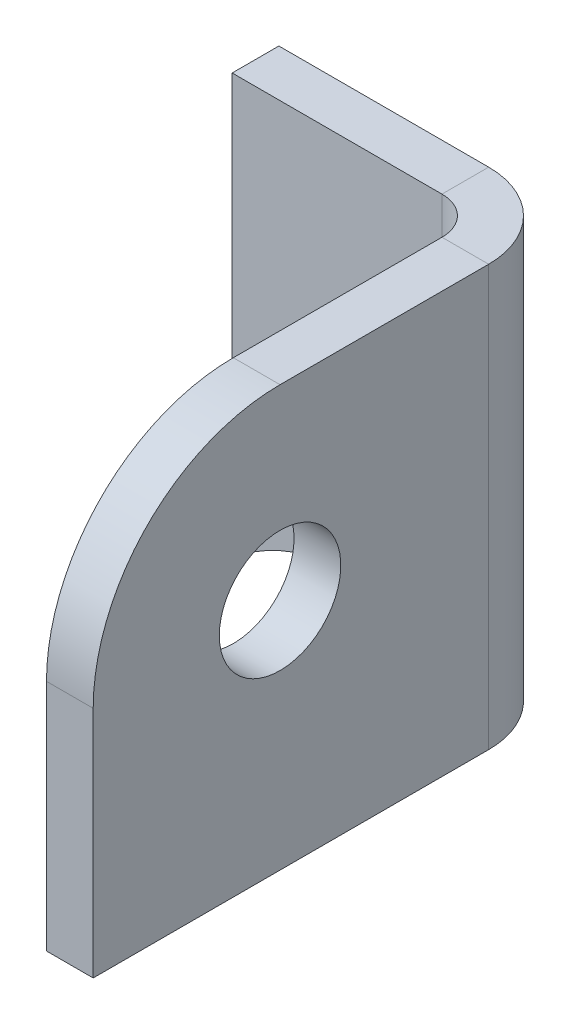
ISO-10303-21;
HEADER;
FILE_DESCRIPTION(('STEP AP214'),'2;1');
FILE_NAME('part.step','',(''),(''),'','','');
FILE_SCHEMA(('AUTOMOTIVE_DESIGN { 1 0 10303 214 1 1 1 1 }'));
ENDSEC;
DATA;
#1=APPLICATION_CONTEXT('core data for automotive mechanical design processes');
#2=APPLICATION_PROTOCOL_DEFINITION('international standard','automotive_design',2000,#1);
#3=PRODUCT_CONTEXT('',#1,'mechanical');
#4=PRODUCT('Part','Part','',(#3));
#5=PRODUCT_RELATED_PRODUCT_CATEGORY('part','',(#4));
#6=PRODUCT_DEFINITION_FORMATION('','',#4);
#7=PRODUCT_DEFINITION_CONTEXT('part definition',#1,'design');
#8=PRODUCT_DEFINITION('design','',#6,#7);
#9=PRODUCT_DEFINITION_SHAPE('','',#8);
#10=(LENGTH_UNIT() NAMED_UNIT(*) SI_UNIT(.MILLI.,.METRE.));
#11=(NAMED_UNIT(*) PLANE_ANGLE_UNIT() SI_UNIT($,.RADIAN.));
#12=(NAMED_UNIT(*) SI_UNIT($,.STERADIAN.) SOLID_ANGLE_UNIT());
#13=UNCERTAINTY_MEASURE_WITH_UNIT(LENGTH_MEASURE(1.E-05),#10,'distance_accuracy_value','');
#14=(GEOMETRIC_REPRESENTATION_CONTEXT(3) GLOBAL_UNCERTAINTY_ASSIGNED_CONTEXT((#13)) GLOBAL_UNIT_ASSIGNED_CONTEXT((#10,
#11,#12)) REPRESENTATION_CONTEXT('',''));
#15=CARTESIAN_POINT('',(0.,0.,0.));
#16=DIRECTION('',(0.,0.,1.));
#17=DIRECTION('',(1.,0.,0.));
#18=AXIS2_PLACEMENT_3D('',#15,#16,#17);
#19=CARTESIAN_POINT('',(16.80052301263,1.08510692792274E-06,1.77153816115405));
#20=DIRECTION('',(0.,-1.,0.));
#21=DIRECTION('',(0.,0.,1.));
#22=AXIS2_PLACEMENT_3D('',#19,#20,#21);
#23=PLANE('',#22);
#24=DIRECTION('',(0.,0.,1.));
#25=VECTOR('',#24,1.);
#26=CARTESIAN_POINT('',(16.80052301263,1.08510692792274E-06,1.77153816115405));
#27=LINE('',#26,#25);
#28=CARTESIAN_POINT('',(16.80052301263,1.08510692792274E-06,5.71500000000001));
#29=VERTEX_POINT('',#28);
#30=CARTESIAN_POINT('',(16.8005230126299,1.08510692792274E-06,32.596015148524));
#31=VERTEX_POINT('',#30);
#32=EDGE_CURVE('E155',#29,#31,#27,.T.);
#33=ORIENTED_EDGE('',*,*,#32,.F.);
#34=DIRECTION('',(1.,0.,0.));
#35=VECTOR('',#34,1.);
#36=CARTESIAN_POINT('',(16.80052301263,1.08510692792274E-06,5.71500000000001));
#37=LINE('',#36,#35);
#38=CARTESIAN_POINT('',(19.97552301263,1.08510691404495E-06,5.71500000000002));
#39=VERTEX_POINT('',#38);
#40=EDGE_CURVE('E12',#29,#39,#37,.T.);
#41=ORIENTED_EDGE('',*,*,#40,.T.);
#42=DIRECTION('',(0.,0.,1.));
#43=VECTOR('',#42,1.);
#44=CARTESIAN_POINT('',(19.9755230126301,1.08510692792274E-06,-6.62872272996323));
#45=LINE('',#44,#43);
#46=CARTESIAN_POINT('',(19.9755230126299,1.08510692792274E-06,32.596015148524));
#47=VERTEX_POINT('',#46);
#48=EDGE_CURVE('E120',#39,#47,#45,.T.);
#49=ORIENTED_EDGE('',*,*,#48,.T.);
#50=DIRECTION('',(-1.,0.,0.));
#51=VECTOR('',#50,1.);
#52=CARTESIAN_POINT('',(16.8005230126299,1.08510692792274E-06,32.596015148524));
#53=LINE('',#52,#51);
#54=EDGE_CURVE('E163',#47,#31,#53,.T.);
#55=ORIENTED_EDGE('',*,*,#54,.T.);
#56=EDGE_LOOP('',(#33,#41,#49,#55));
#57=FACE_BOUND('',#56,.T.);
#58=ADVANCED_FACE('F77',(#57),#23,.T.);
#59=CARTESIAN_POINT('',(16.80052301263,28.575,19.8960151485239));
#60=DIRECTION('',(0.,1.,0.));
#61=DIRECTION('',(0.,0.,-1.));
#62=AXIS2_PLACEMENT_3D('',#59,#60,#61);
#63=PLANE('',#62);
#64=DIRECTION('',(0.,0.,1.));
#65=VECTOR('',#64,1.);
#66=CARTESIAN_POINT('',(19.9755230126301,28.575,-6.62872272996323));
#67=LINE('',#66,#65);
#68=CARTESIAN_POINT('',(19.97552301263,28.575,19.896015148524));
#69=VERTEX_POINT('',#68);
#70=CARTESIAN_POINT('',(19.97552301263,28.575,5.71500000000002));
#71=VERTEX_POINT('',#70);
#72=EDGE_CURVE('E187',#69,#71,#67,.F.);
#73=ORIENTED_EDGE('',*,*,#72,.T.);
#74=DIRECTION('',(-1.,0.,0.));
#75=VECTOR('',#74,1.);
#76=CARTESIAN_POINT('',(16.80052301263,28.575,5.71500000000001));
#77=LINE('',#76,#75);
#78=CARTESIAN_POINT('',(16.80052301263,28.575,5.71500000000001));
#79=VERTEX_POINT('',#78);
#80=EDGE_CURVE('E200',#71,#79,#77,.T.);
#81=ORIENTED_EDGE('',*,*,#80,.T.);
#82=DIRECTION('',(0.,0.,-1.));
#83=VECTOR('',#82,1.);
#84=CARTESIAN_POINT('',(16.80052301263,28.575,19.8960151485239));
#85=LINE('',#84,#83);
#86=CARTESIAN_POINT('',(16.80052301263,28.575,19.8960151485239));
#87=VERTEX_POINT('',#86);
#88=EDGE_CURVE('E80',#87,#79,#85,.T.);
#89=ORIENTED_EDGE('',*,*,#88,.F.);
#90=DIRECTION('',(-1.,0.,0.));
#91=VECTOR('',#90,1.);
#92=CARTESIAN_POINT('',(16.80052301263,28.575,19.8960151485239));
#93=LINE('',#92,#91);
#94=EDGE_CURVE('E103',#69,#87,#93,.T.);
#95=ORIENTED_EDGE('',*,*,#94,.F.);
#96=EDGE_LOOP('',(#73,#81,#89,#95));
#97=FACE_BOUND('',#96,.T.);
#98=ADVANCED_FACE('F216',(#97),#63,.T.);
#99=CARTESIAN_POINT('',(16.8005230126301,-9.52499945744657,-6.62872272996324));
#100=DIRECTION('',(-1.,0.,0.));
#101=DIRECTION('',(0.,0.,1.));
#102=AXIS2_PLACEMENT_3D('',#99,#100,#101);
#103=PLANE('',#102);
#104=CARTESIAN_POINT('',(16.80052301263,15.875,19.896015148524));
#105=DIRECTION('',(-1.,0.,0.));
#106=DIRECTION('',(0.,0.,1.));
#107=AXIS2_PLACEMENT_3D('',#104,#105,#106);
#108=CIRCLE('',#107,4.1275);
#109=CARTESIAN_POINT('',(16.80052301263,15.875,24.023515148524));
#110=VERTEX_POINT('',#109);
#111=EDGE_CURVE('E180',#110,#110,#108,.T.);
#112=ORIENTED_EDGE('',*,*,#111,.F.);
#113=EDGE_LOOP('',(#112));
#114=FACE_BOUND('',#113,.T.);
#115=ORIENTED_EDGE('',*,*,#88,.T.);
#116=DIRECTION('',(0.,-1.,0.));
#117=VECTOR('',#116,1.);
#118=CARTESIAN_POINT('',(16.80052301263,-9.52499945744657,5.71500000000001));
#119=LINE('',#118,#117);
#120=EDGE_CURVE('E160',#79,#29,#119,.T.);
#121=ORIENTED_EDGE('',*,*,#120,.T.);
#122=ORIENTED_EDGE('',*,*,#32,.T.);
#123=DIRECTION('',(0.,1.,0.));
#124=VECTOR('',#123,1.);
#125=CARTESIAN_POINT('',(16.8005230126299,1.08510692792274E-06,32.596015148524));
#126=LINE('',#125,#124);
#127=CARTESIAN_POINT('',(16.8005230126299,15.8749999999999,32.596015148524));
#128=VERTEX_POINT('',#127);
#129=EDGE_CURVE('E159',#31,#128,#126,.T.);
#130=ORIENTED_EDGE('',*,*,#129,.T.);
#131=CARTESIAN_POINT('',(16.80052301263,15.875,19.896015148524));
#132=DIRECTION('',(-1.,0.,0.));
#133=DIRECTION('',(0.,0.,1.));
#134=AXIS2_PLACEMENT_3D('',#131,#132,#133);
#135=CIRCLE('',#134,12.7);
#136=EDGE_CURVE('E172',#128,#87,#135,.T.);
#137=ORIENTED_EDGE('',*,*,#136,.T.);
#138=EDGE_LOOP('',(#115,#121,#122,#130,#137));
#139=FACE_BOUND('',#138,.T.);
#140=ADVANCED_FACE('F157',(#114,#139),#103,.T.);
#141=CARTESIAN_POINT('',(16.8005230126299,1.08510692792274E-06,32.596015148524));
#142=DIRECTION('',(0.,0.,1.));
#143=DIRECTION('',(0.,1.,0.));
#144=AXIS2_PLACEMENT_3D('',#141,#142,#143);
#145=PLANE('',#144);
#146=ORIENTED_EDGE('',*,*,#54,.F.);
#147=DIRECTION('',(0.,1.,0.));
#148=VECTOR('',#147,1.);
#149=CARTESIAN_POINT('',(19.9755230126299,-9.52499945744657,32.596015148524));
#150=LINE('',#149,#148);
#151=CARTESIAN_POINT('',(19.9755230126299,15.8749999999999,32.596015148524));
#152=VERTEX_POINT('',#151);
#153=EDGE_CURVE('E188',#47,#152,#150,.T.);
#154=ORIENTED_EDGE('',*,*,#153,.T.);
#155=DIRECTION('',(-1.,0.,0.));
#156=VECTOR('',#155,1.);
#157=CARTESIAN_POINT('',(16.8005230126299,15.8749999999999,32.596015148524));
#158=LINE('',#157,#156);
#159=EDGE_CURVE('E168',#152,#128,#158,.T.);
#160=ORIENTED_EDGE('',*,*,#159,.T.);
#161=ORIENTED_EDGE('',*,*,#129,.F.);
#162=EDGE_LOOP('',(#146,#154,#160,#161));
#163=FACE_BOUND('',#162,.T.);
#164=ADVANCED_FACE('F170',(#163),#145,.T.);
#165=CARTESIAN_POINT('',(16.80052301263,15.875,19.896015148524));
#166=DIRECTION('',(-1.,0.,0.));
#167=DIRECTION('',(0.,0.,1.));
#168=AXIS2_PLACEMENT_3D('',#165,#166,#167);
#169=CYLINDRICAL_SURFACE('',#168,12.7);
#170=ORIENTED_EDGE('',*,*,#159,.F.);
#171=CARTESIAN_POINT('',(19.97552301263,15.875,19.8960151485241));
#172=DIRECTION('',(-1.,0.,0.));
#173=DIRECTION('',(0.,0.,1.));
#174=AXIS2_PLACEMENT_3D('',#171,#172,#173);
#175=CIRCLE('',#174,12.7);
#176=EDGE_CURVE('E184',#152,#69,#175,.T.);
#177=ORIENTED_EDGE('',*,*,#176,.T.);
#178=ORIENTED_EDGE('',*,*,#94,.T.);
#179=ORIENTED_EDGE('',*,*,#136,.F.);
#180=EDGE_LOOP('',(#170,#177,#178,#179));
#181=FACE_BOUND('',#180,.T.);
#182=ADVANCED_FACE('F347',(#181),#169,.T.);
#183=CARTESIAN_POINT('',(16.80052301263,15.875,19.896015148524));
#184=DIRECTION('',(-1.,0.,0.));
#185=DIRECTION('',(0.,0.,1.));
#186=AXIS2_PLACEMENT_3D('',#183,#184,#185);
#187=CYLINDRICAL_SURFACE('',#186,4.1275);
#188=ORIENTED_EDGE('',*,*,#111,.T.);
#189=EDGE_LOOP('',(#188));
#190=FACE_BOUND('',#189,.T.);
#191=CARTESIAN_POINT('',(19.97552301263,15.875,19.8960151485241));
#192=DIRECTION('',(-1.,0.,0.));
#193=DIRECTION('',(0.,0.,1.));
#194=AXIS2_PLACEMENT_3D('',#191,#192,#193);
#195=CIRCLE('',#194,4.1275);
#196=CARTESIAN_POINT('',(19.97552301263,15.875,24.023515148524));
#197=VERTEX_POINT('',#196);
#198=EDGE_CURVE('E162',#197,#197,#195,.T.);
#199=ORIENTED_EDGE('',*,*,#198,.F.);
#200=EDGE_LOOP('',(#199));
#201=FACE_BOUND('',#200,.T.);
#202=ADVANCED_FACE('F441',(#190,#201),#187,.F.);
#203=CARTESIAN_POINT('',(19.9755230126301,-9.52499945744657,-6.62872272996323));
#204=DIRECTION('',(-1.,0.,0.));
#205=DIRECTION('',(0.,0.,1.));
#206=AXIS2_PLACEMENT_3D('',#203,#204,#205);
#207=PLANE('',#206);
#208=DIRECTION('',(0.,-1.,0.));
#209=VECTOR('',#208,1.);
#210=CARTESIAN_POINT('',(19.97552301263,-9.52499945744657,5.71500000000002));
#211=LINE('',#210,#209);
#212=EDGE_CURVE('E86',#71,#39,#211,.T.);
#213=ORIENTED_EDGE('',*,*,#212,.F.);
#214=ORIENTED_EDGE('',*,*,#72,.F.);
#215=ORIENTED_EDGE('',*,*,#176,.F.);
#216=ORIENTED_EDGE('',*,*,#153,.F.);
#217=ORIENTED_EDGE('',*,*,#48,.F.);
#218=EDGE_LOOP('',(#213,#214,#215,#216,#217));
#219=FACE_BOUND('',#218,.T.);
#220=ORIENTED_EDGE('',*,*,#198,.T.);
#221=EDGE_LOOP('',(#220));
#222=FACE_BOUND('',#221,.T.);
#223=ADVANCED_FACE('F224',(#219,#222),#207,.F.);
#224=CARTESIAN_POINT('',(0.,0.,3.175));
#225=DIRECTION('',(-1.,0.,0.));
#226=DIRECTION('',(0.,-1.,0.));
#227=AXIS2_PLACEMENT_3D('',#224,#225,#226);
#228=PLANE('',#227);
#229=DIRECTION('',(0.,0.,1.));
#230=VECTOR('',#229,1.);
#231=CARTESIAN_POINT('',(0.,28.575,3.175));
#232=LINE('',#231,#230);
#233=CARTESIAN_POINT('',(0.,28.575,0.));
#234=VERTEX_POINT('',#233);
#235=CARTESIAN_POINT('',(0.,28.575,3.175));
#236=VERTEX_POINT('',#235);
#237=EDGE_CURVE('E316',#234,#236,#232,.T.);
#238=ORIENTED_EDGE('',*,*,#237,.F.);
#239=DIRECTION('',(0.,1.,0.));
#240=VECTOR('',#239,1.);
#241=CARTESIAN_POINT('',(0.,-9.52499945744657,0.));
#242=LINE('',#241,#240);
#243=CARTESIAN_POINT('',(0.,0.,0.));
#244=VERTEX_POINT('',#243);
#245=EDGE_CURVE('E383',#234,#244,#242,.F.);
#246=ORIENTED_EDGE('',*,*,#245,.T.);
#247=DIRECTION('',(0.,0.,1.));
#248=VECTOR('',#247,1.);
#249=CARTESIAN_POINT('',(0.,0.,3.175));
#250=LINE('',#249,#248);
#251=CARTESIAN_POINT('',(0.,0.,3.175));
#252=VERTEX_POINT('',#251);
#253=EDGE_CURVE('E129',#244,#252,#250,.T.);
#254=ORIENTED_EDGE('',*,*,#253,.T.);
#255=DIRECTION('',(0.,-1.,0.));
#256=VECTOR('',#255,1.);
#257=CARTESIAN_POINT('',(0.,0.,3.175));
#258=LINE('',#257,#256);
#259=EDGE_CURVE('E370',#236,#252,#258,.T.);
#260=ORIENTED_EDGE('',*,*,#259,.F.);
#261=EDGE_LOOP('',(#238,#246,#254,#260));
#262=FACE_BOUND('',#261,.T.);
#263=ADVANCED_FACE('F327',(#262),#228,.T.);
#264=CARTESIAN_POINT('',(8.40026212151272,-9.52499945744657,3.175));
#265=DIRECTION('',(0.,0.,1.));
#266=DIRECTION('',(1.,0.,0.));
#267=AXIS2_PLACEMENT_3D('',#264,#265,#266);
#268=PLANE('',#267);
#269=DIRECTION('',(0.,-1.,0.));
#270=VECTOR('',#269,1.);
#271=CARTESIAN_POINT('',(14.26052301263,-9.52499945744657,3.175));
#272=LINE('',#271,#270);
#273=CARTESIAN_POINT('',(14.26052301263,28.575,3.175));
#274=VERTEX_POINT('',#273);
#275=CARTESIAN_POINT('',(14.26052301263,1.74209247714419,3.175));
#276=VERTEX_POINT('',#275);
#277=EDGE_CURVE('E356',#274,#276,#272,.T.);
#278=ORIENTED_EDGE('',*,*,#277,.F.);
#279=DIRECTION('',(-1.,0.,0.));
#280=VECTOR('',#279,1.);
#281=CARTESIAN_POINT('',(34.9249999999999,28.575,3.175));
#282=LINE('',#281,#280);
#283=EDGE_CURVE('E375',#274,#236,#282,.T.);
#284=ORIENTED_EDGE('',*,*,#283,.T.);
#285=ORIENTED_EDGE('',*,*,#259,.T.);
#286=CARTESIAN_POINT('',(8.40026212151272,-9.52499945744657,3.175));
#287=DIRECTION('',(0.,0.,-1.));
#288=DIRECTION('',(1.,0.,0.));
#289=AXIS2_PLACEMENT_3D('',#286,#287,#288);
#290=CIRCLE('',#289,12.7000007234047);
#291=EDGE_CURVE('E367',#252,#276,#290,.T.);
#292=ORIENTED_EDGE('',*,*,#291,.T.);
#293=EDGE_LOOP('',(#278,#284,#285,#292));
#294=FACE_BOUND('',#293,.T.);
#295=ADVANCED_FACE('F330',(#294),#268,.T.);
#296=CARTESIAN_POINT('',(34.9249999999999,28.575,3.175));
#297=DIRECTION('',(0.,1.,0.));
#298=DIRECTION('',(-1.,0.,0.));
#299=AXIS2_PLACEMENT_3D('',#296,#297,#298);
#300=PLANE('',#299);
#301=DIRECTION('',(0.,0.,1.));
#302=VECTOR('',#301,1.);
#303=CARTESIAN_POINT('',(14.26052301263,28.575,3.175));
#304=LINE('',#303,#302);
#305=CARTESIAN_POINT('',(14.26052301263,28.575,0.));
#306=VERTEX_POINT('',#305);
#307=EDGE_CURVE('E387',#306,#274,#304,.T.);
#308=ORIENTED_EDGE('',*,*,#307,.F.);
#309=DIRECTION('',(1.,0.,0.));
#310=VECTOR('',#309,1.);
#311=CARTESIAN_POINT('',(8.40026212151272,28.575,0.));
#312=LINE('',#311,#310);
#313=EDGE_CURVE('E369',#306,#234,#312,.F.);
#314=ORIENTED_EDGE('',*,*,#313,.T.);
#315=ORIENTED_EDGE('',*,*,#237,.T.);
#316=ORIENTED_EDGE('',*,*,#283,.F.);
#317=EDGE_LOOP('',(#308,#314,#315,#316));
#318=FACE_BOUND('',#317,.T.);
#319=ADVANCED_FACE('F334',(#318),#300,.T.);
#320=CARTESIAN_POINT('',(8.40026212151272,-9.52499945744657,0.));
#321=DIRECTION('',(0.,0.,1.));
#322=DIRECTION('',(1.,0.,0.));
#323=AXIS2_PLACEMENT_3D('',#320,#321,#322);
#324=PLANE('',#323);
#325=ORIENTED_EDGE('',*,*,#313,.F.);
#326=DIRECTION('',(0.,-1.,0.));
#327=VECTOR('',#326,1.);
#328=CARTESIAN_POINT('',(14.26052301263,-9.52499945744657,0.));
#329=LINE('',#328,#327);
#330=CARTESIAN_POINT('',(14.26052301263,1.74209247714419,0.));
#331=VERTEX_POINT('',#330);
#332=EDGE_CURVE('E393',#306,#331,#329,.T.);
#333=ORIENTED_EDGE('',*,*,#332,.T.);
#334=CARTESIAN_POINT('',(8.40026212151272,-9.52499945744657,0.));
#335=DIRECTION('',(0.,0.,-1.));
#336=DIRECTION('',(-1.,0.,0.));
#337=AXIS2_PLACEMENT_3D('',#334,#335,#336);
#338=CIRCLE('',#337,12.7000007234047);
#339=EDGE_CURVE('E209',#244,#331,#338,.T.);
#340=ORIENTED_EDGE('',*,*,#339,.F.);
#341=ORIENTED_EDGE('',*,*,#245,.F.);
#342=EDGE_LOOP('',(#325,#333,#340,#341));
#343=FACE_BOUND('',#342,.T.);
#344=ADVANCED_FACE('F338',(#343),#324,.F.);
#345=CARTESIAN_POINT('',(8.40026212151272,-9.52499945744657,3.175));
#346=DIRECTION('',(0.,0.,1.));
#347=DIRECTION('',(1.,0.,0.));
#348=AXIS2_PLACEMENT_3D('',#345,#346,#347);
#349=CYLINDRICAL_SURFACE('',#348,12.7000007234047);
#350=CARTESIAN_POINT('',(14.26052301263,1.74209247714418,3.175));
#351=CARTESIAN_POINT('',(14.26052301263,1.74209247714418,0.));
#352=B_SPLINE_CURVE_WITH_KNOTS('',1,(#350,#351),.UNSPECIFIED.,.F.,.F.,(2,2),(0.,1.),.UNSPECIFIED.);
#353=EDGE_CURVE('E365',#276,#331,#352,.T.);
#354=ORIENTED_EDGE('',*,*,#353,.F.);
#355=ORIENTED_EDGE('',*,*,#291,.F.);
#356=ORIENTED_EDGE('',*,*,#253,.F.);
#357=ORIENTED_EDGE('',*,*,#339,.T.);
#358=EDGE_LOOP('',(#354,#355,#356,#357));
#359=FACE_BOUND('',#358,.T.);
#360=ADVANCED_FACE('F342',(#359),#349,.F.);
#361=CARTESIAN_POINT('',(14.26052301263,28.575,5.715));
#362=DIRECTION('',(0.,-1.,0.));
#363=DIRECTION('',(0.,0.,-1.));
#364=AXIS2_PLACEMENT_3D('',#361,#362,#363);
#365=PLANE('',#364);
#366=ORIENTED_EDGE('',*,*,#80,.F.);
#367=CARTESIAN_POINT('',(14.26052301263,28.575,5.715));
#368=DIRECTION('',(0.,1.,0.));
#369=DIRECTION('',(0.,0.,1.));
#370=AXIS2_PLACEMENT_3D('',#367,#368,#369);
#371=CIRCLE('',#370,5.715);
#372=EDGE_CURVE('E235',#71,#306,#371,.T.);
#373=ORIENTED_EDGE('',*,*,#372,.T.);
#374=ORIENTED_EDGE('',*,*,#307,.T.);
#375=CARTESIAN_POINT('',(14.26052301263,28.575,5.715));
#376=DIRECTION('',(0.,1.,0.));
#377=DIRECTION('',(0.,0.,1.));
#378=AXIS2_PLACEMENT_3D('',#375,#376,#377);
#379=CIRCLE('',#378,2.54);
#380=EDGE_CURVE('E244',#79,#274,#379,.T.);
#381=ORIENTED_EDGE('',*,*,#380,.F.);
#382=EDGE_LOOP('',(#366,#373,#374,#381));
#383=FACE_BOUND('',#382,.T.);
#384=ADVANCED_FACE('F280',(#383),#365,.F.);
#385=CARTESIAN_POINT('',(14.26052301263,1.74209247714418,0.));
#386=CARTESIAN_POINT('',(14.9893650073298,1.43357275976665,0.));
#387=CARTESIAN_POINT('',(15.6405817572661,1.13497117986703,0.138241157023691));
#388=CARTESIAN_POINT('',(16.7438913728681,0.554274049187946,0.534490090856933));
#389=CARTESIAN_POINT('',(17.1970453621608,0.272288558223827,0.792069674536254));
#390=CARTESIAN_POINT('',(17.5596360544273,1.08510692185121E-06,1.04840829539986));
#391=CARTESIAN_POINT('',(14.26052301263,1.74209247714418,3.175));
#392=CARTESIAN_POINT('',(14.5842303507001,1.43378461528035,3.175));
#393=CARTESIAN_POINT('',(14.8738824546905,1.13497117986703,3.23644051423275));
#394=CARTESIAN_POINT('',(15.3642422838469,0.554274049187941,3.41255115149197));
#395=CARTESIAN_POINT('',(15.5655055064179,0.272522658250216,3.52693301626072));
#396=CARTESIAN_POINT('',(15.7267954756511,1.0851069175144E-06,3.64095924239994));
#397=B_SPLINE_SURFACE_WITH_KNOTS('',1,3,((#385,#386,#387,#388,#389,#390),(#391,#392,#393,#394,
#395,#396)),.UNSPECIFIED.,.F.,.F.,.F.,(2,2),(4,2,4),(0.,1.),(0.,0.5,1.),.UNSPECIFIED.);
#398=CARTESIAN_POINT('',(14.26052301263,1.74209247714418,0.));
#399=CARTESIAN_POINT('',(14.9893650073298,1.43357275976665,0.));
#400=CARTESIAN_POINT('',(15.6405817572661,1.13497117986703,0.138241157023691));
#401=CARTESIAN_POINT('',(16.7438913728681,0.554274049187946,0.534490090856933));
#402=CARTESIAN_POINT('',(17.1970453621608,0.272288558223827,0.792069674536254));
#403=CARTESIAN_POINT('',(17.5596360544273,1.08510692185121E-06,1.04840829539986));
#404=B_SPLINE_CURVE_WITH_KNOTS('',3,(#398,#399,#400,#401,#402,#403),.UNSPECIFIED.,.F.,.F.,(4,2,
4),(0.,0.5,1.),.UNSPECIFIED.);
#405=CARTESIAN_POINT('',(17.5596360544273,1.08510691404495E-06,1.04840829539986));
#406=VERTEX_POINT('',#405);
#407=EDGE_CURVE('E245',#331,#406,#404,.T.);
#408=CARTESIAN_POINT('',(17.5596360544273,1.08510692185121E-06,1.04840829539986));
#409=CARTESIAN_POINT('',(15.7267954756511,1.0851069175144E-06,3.64095924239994));
#410=B_SPLINE_CURVE_WITH_KNOTS('',1,(#408,#409),.UNSPECIFIED.,.F.,.F.,(2,2),(0.,1.),.UNSPECIFIED.);
#411=CARTESIAN_POINT('',(15.7267954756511,1.0851069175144E-06,3.64095924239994));
#412=VERTEX_POINT('',#411);
#413=EDGE_CURVE('E240',#406,#412,#410,.T.);
#414=CARTESIAN_POINT('',(15.7267954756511,1.0851069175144E-06,3.64095924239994));
#415=CARTESIAN_POINT('',(15.5655055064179,0.272522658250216,3.52693301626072));
#416=CARTESIAN_POINT('',(15.3642422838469,0.554274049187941,3.41255115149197));
#417=CARTESIAN_POINT('',(14.8738824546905,1.13497117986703,3.23644051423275));
#418=CARTESIAN_POINT('',(14.5842303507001,1.43378461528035,3.175));
#419=CARTESIAN_POINT('',(14.26052301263,1.74209247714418,3.175));
#420=B_SPLINE_CURVE_WITH_KNOTS('',3,(#414,#415,#416,#417,#418,#419),.UNSPECIFIED.,.F.,.F.,(4,2,
4),(0.,0.5,1.),.UNSPECIFIED.);
#421=EDGE_CURVE('E250',#276,#412,#420,.F.);
#422=ORIENTED_EDGE('',*,*,#353,.T.);
#423=ORIENTED_EDGE('',*,*,#407,.T.);
#424=ORIENTED_EDGE('',*,*,#413,.T.);
#425=ORIENTED_EDGE('',*,*,#421,.F.);
#426=EDGE_LOOP('',(#422,#423,#424,#425));
#427=FACE_BOUND('',#426,.T.);
#428=ADVANCED_FACE('F269',(#427),#397,.F.);
#429=CARTESIAN_POINT('',(14.26052301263,1.08510692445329E-06,5.715));
#430=DIRECTION('',(0.,1.,0.));
#431=DIRECTION('',(0.,0.,1.));
#432=AXIS2_PLACEMENT_3D('',#429,#430,#431);
#433=PLANE('',#432);
#434=CARTESIAN_POINT('',(14.26052301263,1.08510691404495E-06,5.715));
#435=DIRECTION('',(0.,1.,0.));
#436=DIRECTION('',(0.,0.,1.));
#437=AXIS2_PLACEMENT_3D('',#434,#435,#436);
#438=CIRCLE('',#437,5.715);
#439=EDGE_CURVE('E232',#406,#39,#438,.F.);
#440=ORIENTED_EDGE('',*,*,#439,.T.);
#441=ORIENTED_EDGE('',*,*,#40,.F.);
#442=CARTESIAN_POINT('',(14.26052301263,1.08510692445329E-06,5.715));
#443=DIRECTION('',(0.,-1.,0.));
#444=DIRECTION('',(0.,0.,-1.));
#445=AXIS2_PLACEMENT_3D('',#442,#443,#444);
#446=CIRCLE('',#445,2.54);
#447=EDGE_CURVE('E94',#412,#29,#446,.T.);
#448=ORIENTED_EDGE('',*,*,#447,.F.);
#449=ORIENTED_EDGE('',*,*,#413,.F.);
#450=EDGE_LOOP('',(#440,#441,#448,#449));
#451=FACE_BOUND('',#450,.T.);
#452=ADVANCED_FACE('F238',(#451),#433,.F.);
#453=CARTESIAN_POINT('',(14.26052301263,-14.3142626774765,5.715));
#454=DIRECTION('',(0.,1.,0.));
#455=DIRECTION('',(0.,0.,1.));
#456=AXIS2_PLACEMENT_3D('',#453,#454,#455);
#457=CYLINDRICAL_SURFACE('',#456,2.54);
#458=ORIENTED_EDGE('',*,*,#421,.T.);
#459=ORIENTED_EDGE('',*,*,#447,.T.);
#460=ORIENTED_EDGE('',*,*,#120,.F.);
#461=ORIENTED_EDGE('',*,*,#380,.T.);
#462=ORIENTED_EDGE('',*,*,#277,.T.);
#463=EDGE_LOOP('',(#458,#459,#460,#461,#462));
#464=FACE_BOUND('',#463,.T.);
#465=ADVANCED_FACE('F326',(#464),#457,.F.);
#466=CARTESIAN_POINT('',(14.26052301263,-14.3142626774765,5.715));
#467=DIRECTION('',(0.,1.,0.));
#468=DIRECTION('',(0.,0.,1.));
#469=AXIS2_PLACEMENT_3D('',#466,#467,#468);
#470=CYLINDRICAL_SURFACE('',#469,5.715);
#471=ORIENTED_EDGE('',*,*,#407,.F.);
#472=ORIENTED_EDGE('',*,*,#332,.F.);
#473=ORIENTED_EDGE('',*,*,#372,.F.);
#474=ORIENTED_EDGE('',*,*,#212,.T.);
#475=ORIENTED_EDGE('',*,*,#439,.F.);
#476=EDGE_LOOP('',(#471,#472,#473,#474,#475));
#477=FACE_BOUND('',#476,.T.);
#478=ADVANCED_FACE('F231',(#477),#470,.T.);
#479=CLOSED_SHELL('',(#58,#98,#140,#164,#182,#202,#223,#263,#295,#319,#344,#360,#384,#428,#452,
#465,#478));
#480=MANIFOLD_SOLID_BREP('B2',#479);
#481=ADVANCED_BREP_SHAPE_REPRESENTATION('',(#18,#480),#14);
#482=SHAPE_DEFINITION_REPRESENTATION(#9,#481);
ENDSEC;
END-ISO-10303-21;
